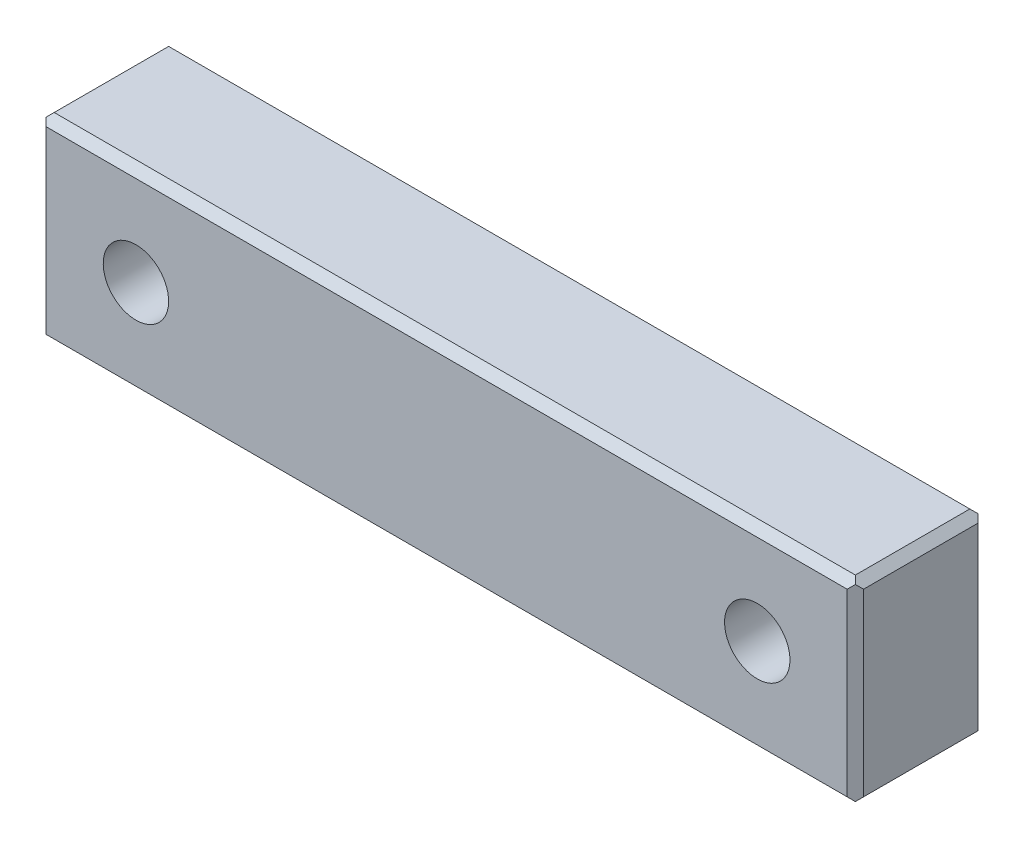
ISO-10303-21;
HEADER;
FILE_DESCRIPTION(('STEP AP214'),'2;1');
FILE_NAME('part.step','',(''),(''),'','','');
FILE_SCHEMA(('AUTOMOTIVE_DESIGN { 1 0 10303 214 1 1 1 1 }'));
ENDSEC;
DATA;
#1=APPLICATION_CONTEXT('core data for automotive mechanical design processes');
#2=APPLICATION_PROTOCOL_DEFINITION('international standard','automotive_design',2000,#1);
#3=PRODUCT_CONTEXT('',#1,'mechanical');
#4=PRODUCT('Part','Part','',(#3));
#5=PRODUCT_RELATED_PRODUCT_CATEGORY('part','',(#4));
#6=PRODUCT_DEFINITION_FORMATION('','',#4);
#7=PRODUCT_DEFINITION_CONTEXT('part definition',#1,'design');
#8=PRODUCT_DEFINITION('design','',#6,#7);
#9=PRODUCT_DEFINITION_SHAPE('','',#8);
#10=(LENGTH_UNIT() NAMED_UNIT(*) SI_UNIT(.MILLI.,.METRE.));
#11=(NAMED_UNIT(*) PLANE_ANGLE_UNIT() SI_UNIT($,.RADIAN.));
#12=(NAMED_UNIT(*) SI_UNIT($,.STERADIAN.) SOLID_ANGLE_UNIT());
#13=UNCERTAINTY_MEASURE_WITH_UNIT(LENGTH_MEASURE(1.E-05),#10,'distance_accuracy_value','');
#14=(GEOMETRIC_REPRESENTATION_CONTEXT(3) GLOBAL_UNCERTAINTY_ASSIGNED_CONTEXT((#13)) GLOBAL_UNIT_ASSIGNED_CONTEXT((#10,
#11,#12)) REPRESENTATION_CONTEXT('',''));
#15=CARTESIAN_POINT('',(0.,0.,0.));
#16=DIRECTION('',(0.,0.,1.));
#17=DIRECTION('',(1.,0.,0.));
#18=AXIS2_PLACEMENT_3D('',#15,#16,#17);
#19=CARTESIAN_POINT('',(396.970096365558,-9.9,173.27));
#20=DIRECTION('',(0.707106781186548,0.,-0.707106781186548));
#21=DIRECTION('',(-0.707106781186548,0.,-0.707106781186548));
#22=AXIS2_PLACEMENT_3D('',#19,#20,#21);
#23=PLANE('',#22);
#24=DIRECTION('',(-0.577350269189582,0.577350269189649,-0.577350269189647));
#25=VECTOR('',#24,1.);
#26=CARTESIAN_POINT('',(397.220096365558,-4.4,173.52));
#27=LINE('',#26,#25);
#28=CARTESIAN_POINT('',(397.220096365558,-4.4,173.52));
#29=VERTEX_POINT('',#28);
#30=CARTESIAN_POINT('',(396.970096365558,-4.15,173.27));
#31=VERTEX_POINT('',#30);
#32=EDGE_CURVE('E125',#29,#31,#27,.T.);
#33=ORIENTED_EDGE('',*,*,#32,.T.);
#34=DIRECTION('',(0.577350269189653,0.577350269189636,0.577350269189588));
#35=VECTOR('',#34,1.);
#36=CARTESIAN_POINT('',(396.720096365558,-4.4,173.02));
#37=LINE('',#36,#35);
#38=CARTESIAN_POINT('',(396.720096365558,-4.4,173.02));
#39=VERTEX_POINT('',#38);
#40=EDGE_CURVE('E156',#39,#31,#37,.T.);
#41=ORIENTED_EDGE('',*,*,#40,.F.);
#42=DIRECTION('',(0.,-1.,0.));
#43=VECTOR('',#42,1.);
#44=CARTESIAN_POINT('',(396.720096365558,-3.9,173.02));
#45=LINE('',#44,#43);
#46=CARTESIAN_POINT('',(396.720096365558,-15.4,173.02));
#47=VERTEX_POINT('',#46);
#48=EDGE_CURVE('E207',#47,#39,#45,.F.);
#49=ORIENTED_EDGE('',*,*,#48,.F.);
#50=DIRECTION('',(0.577350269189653,-0.577350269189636,0.577350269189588));
#51=VECTOR('',#50,1.);
#52=CARTESIAN_POINT('',(396.720096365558,-15.4,173.02));
#53=LINE('',#52,#51);
#54=CARTESIAN_POINT('',(396.970096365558,-15.65,173.27));
#55=VERTEX_POINT('',#54);
#56=EDGE_CURVE('E239',#47,#55,#53,.T.);
#57=ORIENTED_EDGE('',*,*,#56,.T.);
#58=DIRECTION('',(0.577350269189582,0.57735026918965,0.577350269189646));
#59=VECTOR('',#58,1.);
#60=CARTESIAN_POINT('',(396.970096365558,-15.65,173.27));
#61=LINE('',#60,#59);
#62=CARTESIAN_POINT('',(397.220096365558,-15.4,173.52));
#63=VERTEX_POINT('',#62);
#64=EDGE_CURVE('E241',#55,#63,#61,.T.);
#65=ORIENTED_EDGE('',*,*,#64,.T.);
#66=DIRECTION('',(0.,1.,0.));
#67=VECTOR('',#66,1.);
#68=CARTESIAN_POINT('',(397.220096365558,-82.9,173.52));
#69=LINE('',#68,#67);
#70=EDGE_CURVE('E220',#63,#29,#69,.T.);
#71=ORIENTED_EDGE('',*,*,#70,.T.);
#72=EDGE_LOOP('',(#33,#41,#49,#57,#65,#71));
#73=FACE_BOUND('',#72,.T.);
#74=ADVANCED_FACE('F16',(#73),#23,.F.);
#75=CARTESIAN_POINT('',(396.970096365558,-4.15,169.52));
#76=DIRECTION('',(-0.707106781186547,0.707106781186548,0.));
#77=DIRECTION('',(-0.707106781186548,-0.707106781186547,0.));
#78=AXIS2_PLACEMENT_3D('',#75,#76,#77);
#79=PLANE('',#78);
#80=DIRECTION('',(-0.577350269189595,-0.577350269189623,-0.57735026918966));
#81=VECTOR('',#80,1.);
#82=CARTESIAN_POINT('',(397.220096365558,-3.9,166.02));
#83=LINE('',#82,#81);
#84=CARTESIAN_POINT('',(397.220096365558,-3.9,166.02));
#85=VERTEX_POINT('',#84);
#86=CARTESIAN_POINT('',(396.970096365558,-4.15,165.77));
#87=VERTEX_POINT('',#86);
#88=EDGE_CURVE('E141',#85,#87,#83,.T.);
#89=ORIENTED_EDGE('',*,*,#88,.T.);
#90=DIRECTION('',(-0.577350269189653,-0.577350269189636,0.577350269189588));
#91=VECTOR('',#90,1.);
#92=CARTESIAN_POINT('',(396.970096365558,-4.15,165.77));
#93=LINE('',#92,#91);
#94=CARTESIAN_POINT('',(396.720096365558,-4.4,166.02));
#95=VERTEX_POINT('',#94);
#96=EDGE_CURVE('E130',#87,#95,#93,.T.);
#97=ORIENTED_EDGE('',*,*,#96,.T.);
#98=DIRECTION('',(0.,0.,1.));
#99=VECTOR('',#98,1.);
#100=CARTESIAN_POINT('',(396.720096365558,-4.4,173.52));
#101=LINE('',#100,#99);
#102=EDGE_CURVE('E205',#39,#95,#101,.F.);
#103=ORIENTED_EDGE('',*,*,#102,.F.);
#104=ORIENTED_EDGE('',*,*,#40,.T.);
#105=DIRECTION('',(0.577350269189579,0.577350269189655,-0.577350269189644));
#106=VECTOR('',#105,1.);
#107=CARTESIAN_POINT('',(396.970096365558,-4.15,173.27));
#108=LINE('',#107,#106);
#109=CARTESIAN_POINT('',(397.220096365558,-3.9,173.02));
#110=VERTEX_POINT('',#109);
#111=EDGE_CURVE('E257',#31,#110,#108,.T.);
#112=ORIENTED_EDGE('',*,*,#111,.T.);
#113=DIRECTION('',(0.,0.,1.));
#114=VECTOR('',#113,1.);
#115=CARTESIAN_POINT('',(397.220096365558,-3.9,173.52));
#116=LINE('',#115,#114);
#117=EDGE_CURVE('E154',#85,#110,#116,.T.);
#118=ORIENTED_EDGE('',*,*,#117,.F.);
#119=EDGE_LOOP('',(#89,#97,#103,#104,#112,#118));
#120=FACE_BOUND('',#119,.T.);
#121=ADVANCED_FACE('F152',(#120),#79,.T.);
#122=CARTESIAN_POINT('',(421.720096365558,-4.15,173.27));
#123=DIRECTION('',(0.,-0.707106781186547,-0.707106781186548));
#124=DIRECTION('',(0.,0.707106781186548,-0.707106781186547));
#125=AXIS2_PLACEMENT_3D('',#122,#123,#124);
#126=PLANE('',#125);
#127=DIRECTION('',(0.577350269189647,0.577350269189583,-0.577350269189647));
#128=VECTOR('',#127,1.);
#129=CARTESIAN_POINT('',(446.220096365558,-4.4,173.52));
#130=LINE('',#129,#128);
#131=CARTESIAN_POINT('',(446.220096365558,-4.4,173.52));
#132=VERTEX_POINT('',#131);
#133=CARTESIAN_POINT('',(446.470096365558,-4.15,173.27));
#134=VERTEX_POINT('',#133);
#135=EDGE_CURVE('E247',#132,#134,#130,.T.);
#136=ORIENTED_EDGE('',*,*,#135,.T.);
#137=DIRECTION('',(0.577350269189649,-0.577350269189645,0.577350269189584));
#138=VECTOR('',#137,1.);
#139=CARTESIAN_POINT('',(446.220096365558,-3.89999999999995,173.02));
#140=LINE('',#139,#138);
#141=CARTESIAN_POINT('',(446.220096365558,-3.9,173.02));
#142=VERTEX_POINT('',#141);
#143=EDGE_CURVE('E254',#142,#134,#140,.T.);
#144=ORIENTED_EDGE('',*,*,#143,.F.);
#145=DIRECTION('',(1.,0.,0.));
#146=VECTOR('',#145,1.);
#147=CARTESIAN_POINT('',(446.720096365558,-3.9,173.02));
#148=LINE('',#147,#146);
#149=EDGE_CURVE('E198',#110,#142,#148,.T.);
#150=ORIENTED_EDGE('',*,*,#149,.F.);
#151=ORIENTED_EDGE('',*,*,#111,.F.);
#152=ORIENTED_EDGE('',*,*,#32,.F.);
#153=DIRECTION('',(1.,0.,0.));
#154=VECTOR('',#153,1.);
#155=CARTESIAN_POINT('',(411.720096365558,-4.4,173.52));
#156=LINE('',#155,#154);
#157=EDGE_CURVE('E218',#29,#132,#156,.T.);
#158=ORIENTED_EDGE('',*,*,#157,.T.);
#159=EDGE_LOOP('',(#136,#144,#150,#151,#152,#158));
#160=FACE_BOUND('',#159,.T.);
#161=ADVANCED_FACE('F261',(#160),#126,.F.);
#162=CARTESIAN_POINT('',(446.470096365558,-4.15,169.52));
#163=DIRECTION('',(0.707106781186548,0.707106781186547,0.));
#164=DIRECTION('',(-0.707106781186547,0.707106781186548,0.));
#165=AXIS2_PLACEMENT_3D('',#162,#163,#164);
#166=PLANE('',#165);
#167=DIRECTION('',(-0.577350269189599,0.577350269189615,-0.577350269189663));
#168=VECTOR('',#167,1.);
#169=CARTESIAN_POINT('',(446.720096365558,-4.4,166.02));
#170=LINE('',#169,#168);
#171=CARTESIAN_POINT('',(446.720096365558,-4.4,166.02));
#172=VERTEX_POINT('',#171);
#173=CARTESIAN_POINT('',(446.470096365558,-4.15,165.77));
#174=VERTEX_POINT('',#173);
#175=EDGE_CURVE('E251',#172,#174,#170,.T.);
#176=ORIENTED_EDGE('',*,*,#175,.T.);
#177=DIRECTION('',(-0.577350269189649,0.577350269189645,0.577350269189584));
#178=VECTOR('',#177,1.);
#179=CARTESIAN_POINT('',(446.470096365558,-4.15,165.77));
#180=LINE('',#179,#178);
#181=CARTESIAN_POINT('',(446.220096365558,-3.9,166.02));
#182=VERTEX_POINT('',#181);
#183=EDGE_CURVE('E249',#174,#182,#180,.T.);
#184=ORIENTED_EDGE('',*,*,#183,.T.);
#185=DIRECTION('',(0.,0.,1.));
#186=VECTOR('',#185,1.);
#187=CARTESIAN_POINT('',(446.220096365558,-3.9,173.52));
#188=LINE('',#187,#186);
#189=EDGE_CURVE('E202',#142,#182,#188,.F.);
#190=ORIENTED_EDGE('',*,*,#189,.F.);
#191=ORIENTED_EDGE('',*,*,#143,.T.);
#192=DIRECTION('',(0.577350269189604,-0.577350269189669,-0.577350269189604));
#193=VECTOR('',#192,1.);
#194=CARTESIAN_POINT('',(446.470096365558,-4.15,173.27));
#195=LINE('',#194,#193);
#196=CARTESIAN_POINT('',(446.720096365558,-4.4,173.02));
#197=VERTEX_POINT('',#196);
#198=EDGE_CURVE('E245',#134,#197,#195,.T.);
#199=ORIENTED_EDGE('',*,*,#198,.T.);
#200=DIRECTION('',(0.,0.,1.));
#201=VECTOR('',#200,1.);
#202=CARTESIAN_POINT('',(446.720096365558,-4.4,173.52));
#203=LINE('',#202,#201);
#204=EDGE_CURVE('E192',#172,#197,#203,.T.);
#205=ORIENTED_EDGE('',*,*,#204,.F.);
#206=EDGE_LOOP('',(#176,#184,#190,#191,#199,#205));
#207=FACE_BOUND('',#206,.T.);
#208=ADVANCED_FACE('F288',(#207),#166,.T.);
#209=CARTESIAN_POINT('',(446.470096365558,-9.9,173.27));
#210=DIRECTION('',(-0.707106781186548,0.,-0.707106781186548));
#211=DIRECTION('',(-0.707106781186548,0.,0.707106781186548));
#212=AXIS2_PLACEMENT_3D('',#209,#210,#211);
#213=PLANE('',#212);
#214=DIRECTION('',(0.577350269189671,-0.577350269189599,-0.577350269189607));
#215=VECTOR('',#214,1.);
#216=CARTESIAN_POINT('',(446.220096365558,-15.4,173.52));
#217=LINE('',#216,#215);
#218=CARTESIAN_POINT('',(446.220096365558,-15.4,173.52));
#219=VERTEX_POINT('',#218);
#220=CARTESIAN_POINT('',(446.470096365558,-15.65,173.27));
#221=VERTEX_POINT('',#220);
#222=EDGE_CURVE('E243',#219,#221,#217,.T.);
#223=ORIENTED_EDGE('',*,*,#222,.T.);
#224=DIRECTION('',(-0.577350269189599,-0.577350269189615,0.577350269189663));
#225=VECTOR('',#224,1.);
#226=CARTESIAN_POINT('',(446.720096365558,-15.4,173.02));
#227=LINE('',#226,#225);
#228=CARTESIAN_POINT('',(446.720096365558,-15.4,173.02));
#229=VERTEX_POINT('',#228);
#230=EDGE_CURVE('E230',#229,#221,#227,.T.);
#231=ORIENTED_EDGE('',*,*,#230,.F.);
#232=DIRECTION('',(0.,1.,0.));
#233=VECTOR('',#232,1.);
#234=CARTESIAN_POINT('',(446.720096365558,-15.9,173.02));
#235=LINE('',#234,#233);
#236=EDGE_CURVE('E189',#197,#229,#235,.F.);
#237=ORIENTED_EDGE('',*,*,#236,.F.);
#238=ORIENTED_EDGE('',*,*,#198,.F.);
#239=ORIENTED_EDGE('',*,*,#135,.F.);
#240=DIRECTION('',(0.,1.,0.));
#241=VECTOR('',#240,1.);
#242=CARTESIAN_POINT('',(446.220096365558,-82.9,173.52));
#243=LINE('',#242,#241);
#244=EDGE_CURVE('E216',#132,#219,#243,.F.);
#245=ORIENTED_EDGE('',*,*,#244,.T.);
#246=EDGE_LOOP('',(#223,#231,#237,#238,#239,#245));
#247=FACE_BOUND('',#246,.T.);
#248=ADVANCED_FACE('F318',(#247),#213,.F.);
#249=CARTESIAN_POINT('',(421.720096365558,-15.65,173.27));
#250=DIRECTION('',(0.,0.707106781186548,-0.707106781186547));
#251=DIRECTION('',(0.,0.707106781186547,0.707106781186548));
#252=AXIS2_PLACEMENT_3D('',#249,#250,#251);
#253=PLANE('',#252);
#254=ORIENTED_EDGE('',*,*,#64,.F.);
#255=DIRECTION('',(0.577350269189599,-0.577350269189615,-0.577350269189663));
#256=VECTOR('',#255,1.);
#257=CARTESIAN_POINT('',(396.970096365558,-15.65,173.27));
#258=LINE('',#257,#256);
#259=CARTESIAN_POINT('',(397.220096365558,-15.9,173.02));
#260=VERTEX_POINT('',#259);
#261=EDGE_CURVE('E237',#55,#260,#258,.T.);
#262=ORIENTED_EDGE('',*,*,#261,.T.);
#263=DIRECTION('',(1.,0.,0.));
#264=VECTOR('',#263,1.);
#265=CARTESIAN_POINT('',(396.720096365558,-15.9,173.02));
#266=LINE('',#265,#264);
#267=CARTESIAN_POINT('',(446.220096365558,-15.9,173.02));
#268=VERTEX_POINT('',#267);
#269=EDGE_CURVE('E185',#268,#260,#266,.F.);
#270=ORIENTED_EDGE('',*,*,#269,.F.);
#271=DIRECTION('',(-0.577350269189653,-0.577350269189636,-0.577350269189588));
#272=VECTOR('',#271,1.);
#273=CARTESIAN_POINT('',(446.470096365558,-15.65,173.27));
#274=LINE('',#273,#272);
#275=EDGE_CURVE('E227',#221,#268,#274,.T.);
#276=ORIENTED_EDGE('',*,*,#275,.F.);
#277=ORIENTED_EDGE('',*,*,#222,.F.);
#278=DIRECTION('',(1.,0.,0.));
#279=VECTOR('',#278,1.);
#280=CARTESIAN_POINT('',(411.720096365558,-15.4,173.52));
#281=LINE('',#280,#279);
#282=EDGE_CURVE('E213',#219,#63,#281,.F.);
#283=ORIENTED_EDGE('',*,*,#282,.T.);
#284=EDGE_LOOP('',(#254,#262,#270,#276,#277,#283));
#285=FACE_BOUND('',#284,.T.);
#286=ADVANCED_FACE('F313',(#285),#253,.F.);
#287=CARTESIAN_POINT('',(396.970096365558,-15.65,169.52));
#288=DIRECTION('',(0.707106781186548,0.707106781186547,0.));
#289=DIRECTION('',(-0.707106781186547,0.707106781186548,0.));
#290=AXIS2_PLACEMENT_3D('',#287,#288,#289);
#291=PLANE('',#290);
#292=DIRECTION('',(-0.577350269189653,0.577350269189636,0.577350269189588));
#293=VECTOR('',#292,1.);
#294=CARTESIAN_POINT('',(396.970096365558,-15.65,165.77));
#295=LINE('',#294,#293);
#296=CARTESIAN_POINT('',(396.970096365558,-15.65,165.77));
#297=VERTEX_POINT('',#296);
#298=CARTESIAN_POINT('',(396.720096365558,-15.4,166.02));
#299=VERTEX_POINT('',#298);
#300=EDGE_CURVE('E233',#297,#299,#295,.T.);
#301=ORIENTED_EDGE('',*,*,#300,.F.);
#302=DIRECTION('',(-0.577350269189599,0.577350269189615,-0.577350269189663));
#303=VECTOR('',#302,1.);
#304=CARTESIAN_POINT('',(397.220096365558,-15.9,166.02));
#305=LINE('',#304,#303);
#306=CARTESIAN_POINT('',(397.220096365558,-15.9,166.02));
#307=VERTEX_POINT('',#306);
#308=EDGE_CURVE('E235',#307,#297,#305,.T.);
#309=ORIENTED_EDGE('',*,*,#308,.F.);
#310=DIRECTION('',(0.,0.,-1.));
#311=VECTOR('',#310,1.);
#312=CARTESIAN_POINT('',(397.220096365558,-15.9,173.52));
#313=LINE('',#312,#311);
#314=EDGE_CURVE('E178',#260,#307,#313,.T.);
#315=ORIENTED_EDGE('',*,*,#314,.F.);
#316=ORIENTED_EDGE('',*,*,#261,.F.);
#317=ORIENTED_EDGE('',*,*,#56,.F.);
#318=DIRECTION('',(0.,0.,1.));
#319=VECTOR('',#318,1.);
#320=CARTESIAN_POINT('',(396.720096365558,-15.4,173.52));
#321=LINE('',#320,#319);
#322=EDGE_CURVE('E210',#299,#47,#321,.T.);
#323=ORIENTED_EDGE('',*,*,#322,.F.);
#324=EDGE_LOOP('',(#301,#309,#315,#316,#317,#323));
#325=FACE_BOUND('',#324,.T.);
#326=ADVANCED_FACE('F306',(#325),#291,.F.);
#327=CARTESIAN_POINT('',(446.470096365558,-15.65,169.52));
#328=DIRECTION('',(0.707106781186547,-0.707106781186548,0.));
#329=DIRECTION('',(0.707106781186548,0.707106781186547,0.));
#330=AXIS2_PLACEMENT_3D('',#327,#328,#329);
#331=PLANE('',#330);
#332=DIRECTION('',(0.577350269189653,0.577350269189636,-0.577350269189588));
#333=VECTOR('',#332,1.);
#334=CARTESIAN_POINT('',(446.220096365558,-15.9,166.02));
#335=LINE('',#334,#333);
#336=CARTESIAN_POINT('',(446.220096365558,-15.9,166.02));
#337=VERTEX_POINT('',#336);
#338=CARTESIAN_POINT('',(446.470096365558,-15.65,165.77));
#339=VERTEX_POINT('',#338);
#340=EDGE_CURVE('E224',#337,#339,#335,.T.);
#341=ORIENTED_EDGE('',*,*,#340,.T.);
#342=DIRECTION('',(0.577350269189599,0.577350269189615,0.577350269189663));
#343=VECTOR('',#342,1.);
#344=CARTESIAN_POINT('',(446.470096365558,-15.65,165.77));
#345=LINE('',#344,#343);
#346=CARTESIAN_POINT('',(446.720096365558,-15.4,166.02));
#347=VERTEX_POINT('',#346);
#348=EDGE_CURVE('E222',#339,#347,#345,.T.);
#349=ORIENTED_EDGE('',*,*,#348,.T.);
#350=DIRECTION('',(0.,0.,1.));
#351=VECTOR('',#350,1.);
#352=CARTESIAN_POINT('',(446.720096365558,-15.4,173.52));
#353=LINE('',#352,#351);
#354=EDGE_CURVE('E195',#229,#347,#353,.F.);
#355=ORIENTED_EDGE('',*,*,#354,.F.);
#356=ORIENTED_EDGE('',*,*,#230,.T.);
#357=ORIENTED_EDGE('',*,*,#275,.T.);
#358=DIRECTION('',(0.,0.,-1.));
#359=VECTOR('',#358,1.);
#360=CARTESIAN_POINT('',(446.220096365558,-15.9,173.52));
#361=LINE('',#360,#359);
#362=EDGE_CURVE('E174',#337,#268,#361,.F.);
#363=ORIENTED_EDGE('',*,*,#362,.F.);
#364=EDGE_LOOP('',(#341,#349,#355,#356,#357,#363));
#365=FACE_BOUND('',#364,.T.);
#366=ADVANCED_FACE('F298',(#365),#331,.T.);
#367=CARTESIAN_POINT('',(411.720096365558,-82.9,173.52));
#368=DIRECTION('',(0.,0.,-1.));
#369=DIRECTION('',(0.,1.,0.));
#370=AXIS2_PLACEMENT_3D('',#367,#368,#369);
#371=PLANE('',#370);
#372=ORIENTED_EDGE('',*,*,#244,.F.);
#373=ORIENTED_EDGE('',*,*,#157,.F.);
#374=ORIENTED_EDGE('',*,*,#70,.F.);
#375=ORIENTED_EDGE('',*,*,#282,.F.);
#376=EDGE_LOOP('',(#372,#373,#374,#375));
#377=FACE_BOUND('',#376,.T.);
#378=CARTESIAN_POINT('',(440.720096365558,-9.9,173.52));
#379=DIRECTION('',(0.,0.,-1.));
#380=DIRECTION('',(0.,1.,0.));
#381=AXIS2_PLACEMENT_3D('',#378,#379,#380);
#382=CIRCLE('',#381,2.);
#383=CARTESIAN_POINT('',(440.720096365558,-7.9,173.52));
#384=VERTEX_POINT('',#383);
#385=EDGE_CURVE('E19',#384,#384,#382,.T.);
#386=ORIENTED_EDGE('',*,*,#385,.T.);
#387=EDGE_LOOP('',(#386));
#388=FACE_BOUND('',#387,.T.);
#389=CARTESIAN_POINT('',(402.720096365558,-9.9,173.52));
#390=DIRECTION('',(0.,0.,-1.));
#391=DIRECTION('',(0.,1.,0.));
#392=AXIS2_PLACEMENT_3D('',#389,#390,#391);
#393=CIRCLE('',#392,2.);
#394=CARTESIAN_POINT('',(402.720096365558,-7.9,173.52));
#395=VERTEX_POINT('',#394);
#396=EDGE_CURVE('E168',#395,#395,#393,.T.);
#397=ORIENTED_EDGE('',*,*,#396,.T.);
#398=EDGE_LOOP('',(#397));
#399=FACE_BOUND('',#398,.T.);
#400=ADVANCED_FACE('F323',(#377,#388,#399),#371,.F.);
#401=CARTESIAN_POINT('',(396.720096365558,-3.9,173.52));
#402=DIRECTION('',(-1.,0.,0.));
#403=DIRECTION('',(0.,-1.,0.));
#404=AXIS2_PLACEMENT_3D('',#401,#402,#403);
#405=PLANE('',#404);
#406=ORIENTED_EDGE('',*,*,#102,.T.);
#407=DIRECTION('',(0.,1.,0.));
#408=VECTOR('',#407,1.);
#409=CARTESIAN_POINT('',(396.720096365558,-9.9,166.02));
#410=LINE('',#409,#408);
#411=EDGE_CURVE('E136',#299,#95,#410,.T.);
#412=ORIENTED_EDGE('',*,*,#411,.F.);
#413=ORIENTED_EDGE('',*,*,#322,.T.);
#414=ORIENTED_EDGE('',*,*,#48,.T.);
#415=EDGE_LOOP('',(#406,#412,#413,#414));
#416=FACE_BOUND('',#415,.T.);
#417=ADVANCED_FACE('F310',(#416),#405,.T.);
#418=CARTESIAN_POINT('',(446.720096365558,-3.9,173.52));
#419=DIRECTION('',(0.,1.,0.));
#420=DIRECTION('',(0.,0.,1.));
#421=AXIS2_PLACEMENT_3D('',#418,#419,#420);
#422=PLANE('',#421);
#423=ORIENTED_EDGE('',*,*,#117,.T.);
#424=ORIENTED_EDGE('',*,*,#149,.T.);
#425=ORIENTED_EDGE('',*,*,#189,.T.);
#426=DIRECTION('',(1.,0.,0.));
#427=VECTOR('',#426,1.);
#428=CARTESIAN_POINT('',(421.720096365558,-3.9,166.02));
#429=LINE('',#428,#427);
#430=EDGE_CURVE('E150',#85,#182,#429,.T.);
#431=ORIENTED_EDGE('',*,*,#430,.F.);
#432=EDGE_LOOP('',(#423,#424,#425,#431));
#433=FACE_BOUND('',#432,.T.);
#434=ADVANCED_FACE('F264',(#433),#422,.T.);
#435=CARTESIAN_POINT('',(446.720096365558,-15.9,173.52));
#436=DIRECTION('',(1.,0.,0.));
#437=DIRECTION('',(0.,1.,0.));
#438=AXIS2_PLACEMENT_3D('',#435,#436,#437);
#439=PLANE('',#438);
#440=ORIENTED_EDGE('',*,*,#204,.T.);
#441=ORIENTED_EDGE('',*,*,#236,.T.);
#442=ORIENTED_EDGE('',*,*,#354,.T.);
#443=DIRECTION('',(0.,1.,0.));
#444=VECTOR('',#443,1.);
#445=CARTESIAN_POINT('',(446.720096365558,-9.9,166.02));
#446=LINE('',#445,#444);
#447=EDGE_CURVE('E268',#172,#347,#446,.F.);
#448=ORIENTED_EDGE('',*,*,#447,.F.);
#449=EDGE_LOOP('',(#440,#441,#442,#448));
#450=FACE_BOUND('',#449,.T.);
#451=ADVANCED_FACE('F293',(#450),#439,.T.);
#452=CARTESIAN_POINT('',(396.720096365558,-15.9,173.52));
#453=DIRECTION('',(0.,-1.,0.));
#454=DIRECTION('',(0.,0.,-1.));
#455=AXIS2_PLACEMENT_3D('',#452,#453,#454);
#456=PLANE('',#455);
#457=DIRECTION('',(1.,0.,0.));
#458=VECTOR('',#457,1.);
#459=CARTESIAN_POINT('',(421.720096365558,-15.9,166.02));
#460=LINE('',#459,#458);
#461=EDGE_CURVE('E274',#337,#307,#460,.F.);
#462=ORIENTED_EDGE('',*,*,#461,.F.);
#463=ORIENTED_EDGE('',*,*,#362,.T.);
#464=ORIENTED_EDGE('',*,*,#269,.T.);
#465=ORIENTED_EDGE('',*,*,#314,.T.);
#466=EDGE_LOOP('',(#462,#463,#464,#465));
#467=FACE_BOUND('',#466,.T.);
#468=ADVANCED_FACE('F300',(#467),#456,.T.);
#469=CARTESIAN_POINT('',(440.720096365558,-9.9,174.3200024));
#470=DIRECTION('',(0.,0.,-1.));
#471=DIRECTION('',(0.,1.,0.));
#472=AXIS2_PLACEMENT_3D('',#469,#470,#471);
#473=CYLINDRICAL_SURFACE('',#472,2.);
#474=CARTESIAN_POINT('',(440.720096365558,-9.9,165.52));
#475=DIRECTION('',(0.,0.,-1.));
#476=DIRECTION('',(0.,1.,0.));
#477=AXIS2_PLACEMENT_3D('',#474,#475,#476);
#478=CIRCLE('',#477,2.);
#479=CARTESIAN_POINT('',(440.720096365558,-7.9,165.52));
#480=VERTEX_POINT('',#479);
#481=EDGE_CURVE('E165',#480,#480,#478,.F.);
#482=ORIENTED_EDGE('',*,*,#481,.F.);
#483=EDGE_LOOP('',(#482));
#484=FACE_BOUND('',#483,.T.);
#485=ORIENTED_EDGE('',*,*,#385,.F.);
#486=EDGE_LOOP('',(#485));
#487=FACE_BOUND('',#486,.T.);
#488=ADVANCED_FACE('F351',(#484,#487),#473,.F.);
#489=CARTESIAN_POINT('',(402.720096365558,-9.9,174.3200024));
#490=DIRECTION('',(0.,0.,-1.));
#491=DIRECTION('',(0.,1.,0.));
#492=AXIS2_PLACEMENT_3D('',#489,#490,#491);
#493=CYLINDRICAL_SURFACE('',#492,2.);
#494=CARTESIAN_POINT('',(402.720096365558,-9.9,165.52));
#495=DIRECTION('',(0.,0.,-1.));
#496=DIRECTION('',(0.,1.,0.));
#497=AXIS2_PLACEMENT_3D('',#494,#495,#496);
#498=CIRCLE('',#497,2.);
#499=CARTESIAN_POINT('',(402.720096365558,-7.9,165.52));
#500=VERTEX_POINT('',#499);
#501=EDGE_CURVE('E161',#500,#500,#498,.F.);
#502=ORIENTED_EDGE('',*,*,#501,.F.);
#503=EDGE_LOOP('',(#502));
#504=FACE_BOUND('',#503,.T.);
#505=ORIENTED_EDGE('',*,*,#396,.F.);
#506=EDGE_LOOP('',(#505));
#507=FACE_BOUND('',#506,.T.);
#508=ADVANCED_FACE('F348',(#504,#507),#493,.F.);
#509=CARTESIAN_POINT('',(396.970096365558,-9.9,165.77));
#510=DIRECTION('',(-0.707106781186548,0.,-0.707106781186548));
#511=DIRECTION('',(-0.707106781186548,0.,0.707106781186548));
#512=AXIS2_PLACEMENT_3D('',#509,#510,#511);
#513=PLANE('',#512);
#514=ORIENTED_EDGE('',*,*,#96,.F.);
#515=DIRECTION('',(-0.577350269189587,0.577350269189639,0.577350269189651));
#516=VECTOR('',#515,1.);
#517=CARTESIAN_POINT('',(397.220096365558,-4.4,165.52));
#518=LINE('',#517,#516);
#519=CARTESIAN_POINT('',(397.220096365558,-4.4,165.52));
#520=VERTEX_POINT('',#519);
#521=EDGE_CURVE('E133',#520,#87,#518,.T.);
#522=ORIENTED_EDGE('',*,*,#521,.F.);
#523=DIRECTION('',(0.,1.,0.));
#524=VECTOR('',#523,1.);
#525=CARTESIAN_POINT('',(397.220096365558,-82.9,165.52));
#526=LINE('',#525,#524);
#527=CARTESIAN_POINT('',(397.220096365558,-15.4,165.52));
#528=VERTEX_POINT('',#527);
#529=EDGE_CURVE('E164',#528,#520,#526,.T.);
#530=ORIENTED_EDGE('',*,*,#529,.F.);
#531=DIRECTION('',(0.57735026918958,0.577350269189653,-0.577350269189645));
#532=VECTOR('',#531,1.);
#533=CARTESIAN_POINT('',(396.970096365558,-15.65,165.77));
#534=LINE('',#533,#532);
#535=EDGE_CURVE('E167',#297,#528,#534,.T.);
#536=ORIENTED_EDGE('',*,*,#535,.F.);
#537=ORIENTED_EDGE('',*,*,#300,.T.);
#538=ORIENTED_EDGE('',*,*,#411,.T.);
#539=EDGE_LOOP('',(#514,#522,#530,#536,#537,#538));
#540=FACE_BOUND('',#539,.T.);
#541=ADVANCED_FACE('F132',(#540),#513,.T.);
#542=CARTESIAN_POINT('',(421.720096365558,-4.15,165.77));
#543=DIRECTION('',(0.,0.707106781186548,-0.707106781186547));
#544=DIRECTION('',(0.,0.707106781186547,0.707106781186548));
#545=AXIS2_PLACEMENT_3D('',#542,#543,#544);
#546=PLANE('',#545);
#547=ORIENTED_EDGE('',*,*,#183,.F.);
#548=DIRECTION('',(0.577350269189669,0.577350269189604,0.577350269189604));
#549=VECTOR('',#548,1.);
#550=CARTESIAN_POINT('',(446.220096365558,-4.4,165.52));
#551=LINE('',#550,#549);
#552=CARTESIAN_POINT('',(446.220096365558,-4.4,165.52));
#553=VERTEX_POINT('',#552);
#554=EDGE_CURVE('E265',#553,#174,#551,.T.);
#555=ORIENTED_EDGE('',*,*,#554,.F.);
#556=DIRECTION('',(1.,0.,0.));
#557=VECTOR('',#556,1.);
#558=CARTESIAN_POINT('',(411.720096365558,-4.4,165.52));
#559=LINE('',#558,#557);
#560=EDGE_CURVE('E148',#520,#553,#559,.T.);
#561=ORIENTED_EDGE('',*,*,#560,.F.);
#562=ORIENTED_EDGE('',*,*,#521,.T.);
#563=ORIENTED_EDGE('',*,*,#88,.F.);
#564=ORIENTED_EDGE('',*,*,#430,.T.);
#565=EDGE_LOOP('',(#547,#555,#561,#562,#563,#564));
#566=FACE_BOUND('',#565,.T.);
#567=ADVANCED_FACE('F144',(#566),#546,.T.);
#568=CARTESIAN_POINT('',(446.470096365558,-9.9,165.77));
#569=DIRECTION('',(0.707106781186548,0.,-0.707106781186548));
#570=DIRECTION('',(-0.707106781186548,0.,-0.707106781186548));
#571=AXIS2_PLACEMENT_3D('',#568,#569,#570);
#572=PLANE('',#571);
#573=ORIENTED_EDGE('',*,*,#348,.F.);
#574=DIRECTION('',(0.57735026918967,-0.577350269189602,0.577350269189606));
#575=VECTOR('',#574,1.);
#576=CARTESIAN_POINT('',(446.220096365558,-15.4,165.52));
#577=LINE('',#576,#575);
#578=CARTESIAN_POINT('',(446.220096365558,-15.4,165.52));
#579=VERTEX_POINT('',#578);
#580=EDGE_CURVE('E34',#579,#339,#577,.T.);
#581=ORIENTED_EDGE('',*,*,#580,.F.);
#582=DIRECTION('',(0.,1.,0.));
#583=VECTOR('',#582,1.);
#584=CARTESIAN_POINT('',(446.220096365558,-82.9,165.52));
#585=LINE('',#584,#583);
#586=EDGE_CURVE('E25',#553,#579,#585,.F.);
#587=ORIENTED_EDGE('',*,*,#586,.F.);
#588=ORIENTED_EDGE('',*,*,#554,.T.);
#589=ORIENTED_EDGE('',*,*,#175,.F.);
#590=ORIENTED_EDGE('',*,*,#447,.T.);
#591=EDGE_LOOP('',(#573,#581,#587,#588,#589,#590));
#592=FACE_BOUND('',#591,.T.);
#593=ADVANCED_FACE('F285',(#592),#572,.T.);
#594=CARTESIAN_POINT('',(421.720096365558,-15.65,165.77));
#595=DIRECTION('',(0.,-0.707106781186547,-0.707106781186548));
#596=DIRECTION('',(0.,0.707106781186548,-0.707106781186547));
#597=AXIS2_PLACEMENT_3D('',#594,#595,#596);
#598=PLANE('',#597);
#599=ORIENTED_EDGE('',*,*,#308,.T.);
#600=ORIENTED_EDGE('',*,*,#535,.T.);
#601=DIRECTION('',(1.,0.,0.));
#602=VECTOR('',#601,1.);
#603=CARTESIAN_POINT('',(411.720096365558,-15.4,165.52));
#604=LINE('',#603,#602);
#605=EDGE_CURVE('E11',#579,#528,#604,.F.);
#606=ORIENTED_EDGE('',*,*,#605,.F.);
#607=ORIENTED_EDGE('',*,*,#580,.T.);
#608=ORIENTED_EDGE('',*,*,#340,.F.);
#609=ORIENTED_EDGE('',*,*,#461,.T.);
#610=EDGE_LOOP('',(#599,#600,#606,#607,#608,#609));
#611=FACE_BOUND('',#610,.T.);
#612=ADVANCED_FACE('F297',(#611),#598,.T.);
#613=CARTESIAN_POINT('',(411.720096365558,-82.9,165.52));
#614=DIRECTION('',(0.,0.,-1.));
#615=DIRECTION('',(0.,1.,0.));
#616=AXIS2_PLACEMENT_3D('',#613,#614,#615);
#617=PLANE('',#616);
#618=ORIENTED_EDGE('',*,*,#586,.T.);
#619=ORIENTED_EDGE('',*,*,#605,.T.);
#620=ORIENTED_EDGE('',*,*,#529,.T.);
#621=ORIENTED_EDGE('',*,*,#560,.T.);
#622=EDGE_LOOP('',(#618,#619,#620,#621));
#623=FACE_BOUND('',#622,.T.);
#624=ORIENTED_EDGE('',*,*,#501,.T.);
#625=EDGE_LOOP('',(#624));
#626=FACE_BOUND('',#625,.T.);
#627=ORIENTED_EDGE('',*,*,#481,.T.);
#628=EDGE_LOOP('',(#627));
#629=FACE_BOUND('',#628,.T.);
#630=ADVANCED_FACE('F283',(#623,#626,#629),#617,.T.);
#631=CLOSED_SHELL('',(#74,#121,#161,#208,#248,#286,#326,#366,#400,#417,#434,#451,#468,#488,#508,
#541,#567,#593,#612,#630));
#632=MANIFOLD_SOLID_BREP('B1',#631);
#633=ADVANCED_BREP_SHAPE_REPRESENTATION('',(#18,#632),#14);
#634=SHAPE_DEFINITION_REPRESENTATION(#9,#633);
ENDSEC;
END-ISO-10303-21;
